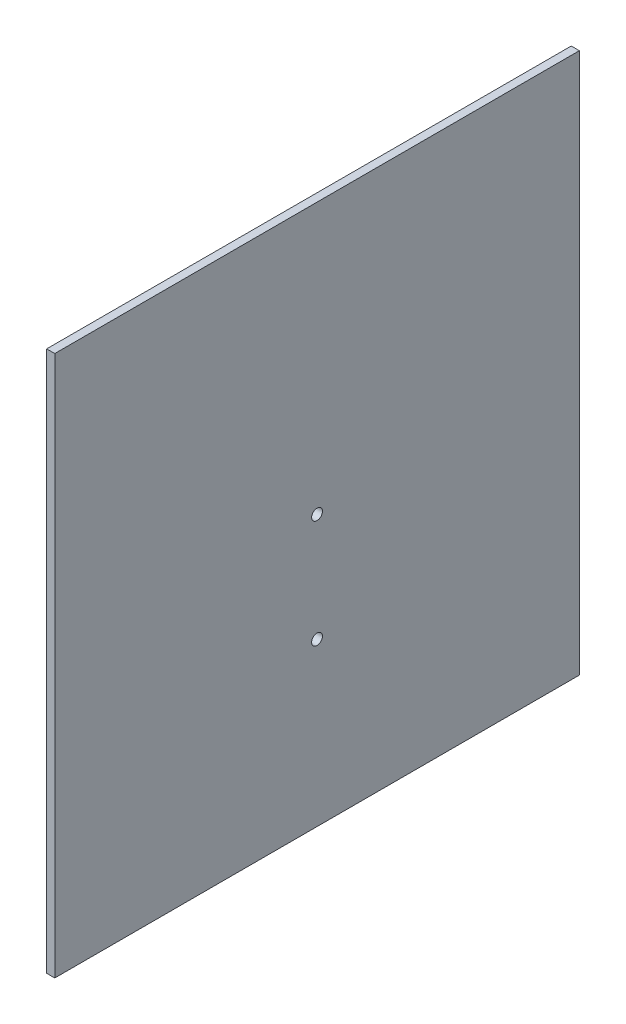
ISO-10303-21;
HEADER;
FILE_DESCRIPTION(('STEP AP214'),'2;1');
FILE_NAME('part.step','',(''),(''),'','','');
FILE_SCHEMA(('AUTOMOTIVE_DESIGN { 1 0 10303 214 1 1 1 1 }'));
ENDSEC;
DATA;
#1=APPLICATION_CONTEXT('core data for automotive mechanical design processes');
#2=APPLICATION_PROTOCOL_DEFINITION('international standard','automotive_design',2000,#1);
#3=PRODUCT_CONTEXT('',#1,'mechanical');
#4=PRODUCT('Part','Part','',(#3));
#5=PRODUCT_RELATED_PRODUCT_CATEGORY('part','',(#4));
#6=PRODUCT_DEFINITION_FORMATION('','',#4);
#7=PRODUCT_DEFINITION_CONTEXT('part definition',#1,'design');
#8=PRODUCT_DEFINITION('design','',#6,#7);
#9=PRODUCT_DEFINITION_SHAPE('','',#8);
#10=(LENGTH_UNIT() NAMED_UNIT(*) SI_UNIT(.MILLI.,.METRE.));
#11=(NAMED_UNIT(*) PLANE_ANGLE_UNIT() SI_UNIT($,.RADIAN.));
#12=(NAMED_UNIT(*) SI_UNIT($,.STERADIAN.) SOLID_ANGLE_UNIT());
#13=UNCERTAINTY_MEASURE_WITH_UNIT(LENGTH_MEASURE(1.E-05),#10,'distance_accuracy_value','');
#14=(GEOMETRIC_REPRESENTATION_CONTEXT(3) GLOBAL_UNCERTAINTY_ASSIGNED_CONTEXT((#13)) GLOBAL_UNIT_ASSIGNED_CONTEXT((#10,
#11,#12)) REPRESENTATION_CONTEXT('',''));
#15=CARTESIAN_POINT('',(0.,0.,0.));
#16=DIRECTION('',(0.,0.,1.));
#17=DIRECTION('',(1.,0.,0.));
#18=AXIS2_PLACEMENT_3D('',#15,#16,#17);
#19=CARTESIAN_POINT('',(3.,100.,-97.));
#20=DIRECTION('',(0.,0.,1.));
#21=DIRECTION('',(0.,-1.,0.));
#22=AXIS2_PLACEMENT_3D('',#19,#20,#21);
#23=PLANE('',#22);
#24=DIRECTION('',(0.,1.,0.));
#25=VECTOR('',#24,1.);
#26=CARTESIAN_POINT('',(0.,100.,-97.));
#27=LINE('',#26,#25);
#28=CARTESIAN_POINT('',(0.,-100.,-97.));
#29=VERTEX_POINT('',#28);
#30=CARTESIAN_POINT('',(0.,100.,-97.));
#31=VERTEX_POINT('',#30);
#32=EDGE_CURVE('E98',#29,#31,#27,.T.);
#33=ORIENTED_EDGE('',*,*,#32,.T.);
#34=DIRECTION('',(-1.,0.,0.));
#35=VECTOR('',#34,1.);
#36=CARTESIAN_POINT('',(3.,100.,-97.));
#37=LINE('',#36,#35);
#38=CARTESIAN_POINT('',(3.,100.,-97.));
#39=VERTEX_POINT('',#38);
#40=EDGE_CURVE('E11',#39,#31,#37,.T.);
#41=ORIENTED_EDGE('',*,*,#40,.F.);
#42=DIRECTION('',(0.,1.,0.));
#43=VECTOR('',#42,1.);
#44=CARTESIAN_POINT('',(3.,100.,-97.));
#45=LINE('',#44,#43);
#46=CARTESIAN_POINT('',(3.,-100.,-97.));
#47=VERTEX_POINT('',#46);
#48=EDGE_CURVE('E85',#47,#39,#45,.T.);
#49=ORIENTED_EDGE('',*,*,#48,.F.);
#50=DIRECTION('',(-1.,0.,0.));
#51=VECTOR('',#50,1.);
#52=CARTESIAN_POINT('',(3.,-100.,-97.));
#53=LINE('',#52,#51);
#54=EDGE_CURVE('E94',#47,#29,#53,.T.);
#55=ORIENTED_EDGE('',*,*,#54,.T.);
#56=EDGE_LOOP('',(#33,#41,#49,#55));
#57=FACE_BOUND('',#56,.T.);
#58=ADVANCED_FACE('F32',(#57),#23,.F.);
#59=CARTESIAN_POINT('',(3.,100.,-97.));
#60=DIRECTION('',(0.,-1.,0.));
#61=DIRECTION('',(0.,0.,-1.));
#62=AXIS2_PLACEMENT_3D('',#59,#60,#61);
#63=PLANE('',#62);
#64=DIRECTION('',(0.,0.,1.));
#65=VECTOR('',#64,1.);
#66=CARTESIAN_POINT('',(0.,100.,-97.));
#67=LINE('',#66,#65);
#68=CARTESIAN_POINT('',(0.,100.,97.));
#69=VERTEX_POINT('',#68);
#70=EDGE_CURVE('E89',#31,#69,#67,.T.);
#71=ORIENTED_EDGE('',*,*,#70,.T.);
#72=DIRECTION('',(-1.,0.,0.));
#73=VECTOR('',#72,1.);
#74=CARTESIAN_POINT('',(3.,100.,97.));
#75=LINE('',#74,#73);
#76=CARTESIAN_POINT('',(3.,100.,97.));
#77=VERTEX_POINT('',#76);
#78=EDGE_CURVE('E41',#77,#69,#75,.T.);
#79=ORIENTED_EDGE('',*,*,#78,.F.);
#80=DIRECTION('',(0.,0.,1.));
#81=VECTOR('',#80,1.);
#82=CARTESIAN_POINT('',(3.,100.,-97.));
#83=LINE('',#82,#81);
#84=EDGE_CURVE('E80',#39,#77,#83,.T.);
#85=ORIENTED_EDGE('',*,*,#84,.F.);
#86=ORIENTED_EDGE('',*,*,#40,.T.);
#87=EDGE_LOOP('',(#71,#79,#85,#86));
#88=FACE_BOUND('',#87,.T.);
#89=ADVANCED_FACE('F88',(#88),#63,.F.);
#90=CARTESIAN_POINT('',(3.,100.,97.));
#91=DIRECTION('',(0.,0.,-1.));
#92=DIRECTION('',(0.,1.,0.));
#93=AXIS2_PLACEMENT_3D('',#90,#91,#92);
#94=PLANE('',#93);
#95=DIRECTION('',(0.,-1.,0.));
#96=VECTOR('',#95,1.);
#97=CARTESIAN_POINT('',(0.,100.,97.));
#98=LINE('',#97,#96);
#99=CARTESIAN_POINT('',(0.,-100.,97.));
#100=VERTEX_POINT('',#99);
#101=EDGE_CURVE('E67',#69,#100,#98,.T.);
#102=ORIENTED_EDGE('',*,*,#101,.T.);
#103=DIRECTION('',(-1.,0.,0.));
#104=VECTOR('',#103,1.);
#105=CARTESIAN_POINT('',(3.,-100.,97.));
#106=LINE('',#105,#104);
#107=CARTESIAN_POINT('',(3.,-100.,97.));
#108=VERTEX_POINT('',#107);
#109=EDGE_CURVE('E90',#108,#100,#106,.T.);
#110=ORIENTED_EDGE('',*,*,#109,.F.);
#111=DIRECTION('',(0.,-1.,0.));
#112=VECTOR('',#111,1.);
#113=CARTESIAN_POINT('',(3.,100.,97.));
#114=LINE('',#113,#112);
#115=EDGE_CURVE('E83',#77,#108,#114,.T.);
#116=ORIENTED_EDGE('',*,*,#115,.F.);
#117=ORIENTED_EDGE('',*,*,#78,.T.);
#118=EDGE_LOOP('',(#102,#110,#116,#117));
#119=FACE_BOUND('',#118,.T.);
#120=ADVANCED_FACE('F92',(#119),#94,.F.);
#121=CARTESIAN_POINT('',(3.,-100.,-97.));
#122=DIRECTION('',(0.,1.,0.));
#123=DIRECTION('',(0.,0.,1.));
#124=AXIS2_PLACEMENT_3D('',#121,#122,#123);
#125=PLANE('',#124);
#126=DIRECTION('',(0.,0.,-1.));
#127=VECTOR('',#126,1.);
#128=CARTESIAN_POINT('',(0.,-100.,-97.));
#129=LINE('',#128,#127);
#130=EDGE_CURVE('E73',#100,#29,#129,.T.);
#131=ORIENTED_EDGE('',*,*,#130,.T.);
#132=ORIENTED_EDGE('',*,*,#54,.F.);
#133=DIRECTION('',(0.,0.,-1.));
#134=VECTOR('',#133,1.);
#135=CARTESIAN_POINT('',(3.,-100.,-97.));
#136=LINE('',#135,#134);
#137=EDGE_CURVE('E50',#108,#47,#136,.T.);
#138=ORIENTED_EDGE('',*,*,#137,.F.);
#139=ORIENTED_EDGE('',*,*,#109,.T.);
#140=EDGE_LOOP('',(#131,#132,#138,#139));
#141=FACE_BOUND('',#140,.T.);
#142=ADVANCED_FACE('F125',(#141),#125,.F.);
#143=CARTESIAN_POINT('',(3.,-100.,-97.));
#144=DIRECTION('',(-1.,0.,0.));
#145=DIRECTION('',(0.,0.,1.));
#146=AXIS2_PLACEMENT_3D('',#143,#144,#145);
#147=PLANE('',#146);
#148=CARTESIAN_POINT('',(3.,-40.,0.));
#149=DIRECTION('',(1.,0.,0.));
#150=DIRECTION('',(0.,0.,-1.));
#151=AXIS2_PLACEMENT_3D('',#148,#149,#150);
#152=CIRCLE('',#151,2.);
#153=CARTESIAN_POINT('',(3.,-40.,-1.99999999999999));
#154=VERTEX_POINT('',#153);
#155=EDGE_CURVE('E115',#154,#154,#152,.T.);
#156=ORIENTED_EDGE('',*,*,#155,.F.);
#157=EDGE_LOOP('',(#156));
#158=FACE_BOUND('',#157,.T.);
#159=CARTESIAN_POINT('',(3.,0.,0.));
#160=DIRECTION('',(1.,0.,0.));
#161=DIRECTION('',(0.,0.,-1.));
#162=AXIS2_PLACEMENT_3D('',#159,#160,#161);
#163=CIRCLE('',#162,2.00000000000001);
#164=CARTESIAN_POINT('',(3.,0.,-2.00000000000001));
#165=VERTEX_POINT('',#164);
#166=EDGE_CURVE('E107',#165,#165,#163,.T.);
#167=ORIENTED_EDGE('',*,*,#166,.F.);
#168=EDGE_LOOP('',(#167));
#169=FACE_BOUND('',#168,.T.);
#170=ORIENTED_EDGE('',*,*,#48,.T.);
#171=ORIENTED_EDGE('',*,*,#84,.T.);
#172=ORIENTED_EDGE('',*,*,#115,.T.);
#173=ORIENTED_EDGE('',*,*,#137,.T.);
#174=EDGE_LOOP('',(#170,#171,#172,#173));
#175=FACE_BOUND('',#174,.T.);
#176=ADVANCED_FACE('F81',(#158,#169,#175),#147,.F.);
#177=CARTESIAN_POINT('',(0.,-100.,-97.));
#178=DIRECTION('',(-1.,0.,0.));
#179=DIRECTION('',(0.,0.,1.));
#180=AXIS2_PLACEMENT_3D('',#177,#178,#179);
#181=PLANE('',#180);
#182=CARTESIAN_POINT('',(0.,-40.,0.));
#183=DIRECTION('',(-1.,0.,0.));
#184=DIRECTION('',(0.,0.,1.));
#185=AXIS2_PLACEMENT_3D('',#182,#183,#184);
#186=CIRCLE('',#185,2.);
#187=CARTESIAN_POINT('',(0.,-40.,2.00000000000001));
#188=VERTEX_POINT('',#187);
#189=EDGE_CURVE('E35',#188,#188,#186,.T.);
#190=ORIENTED_EDGE('',*,*,#189,.F.);
#191=EDGE_LOOP('',(#190));
#192=FACE_BOUND('',#191,.T.);
#193=CARTESIAN_POINT('',(0.,0.,0.));
#194=DIRECTION('',(-1.,0.,0.));
#195=DIRECTION('',(0.,0.,1.));
#196=AXIS2_PLACEMENT_3D('',#193,#194,#195);
#197=CIRCLE('',#196,2.00000000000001);
#198=CARTESIAN_POINT('',(0.,0.,2.00000000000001));
#199=VERTEX_POINT('',#198);
#200=EDGE_CURVE('E101',#199,#199,#197,.T.);
#201=ORIENTED_EDGE('',*,*,#200,.F.);
#202=EDGE_LOOP('',(#201));
#203=FACE_BOUND('',#202,.T.);
#204=ORIENTED_EDGE('',*,*,#32,.F.);
#205=ORIENTED_EDGE('',*,*,#130,.F.);
#206=ORIENTED_EDGE('',*,*,#101,.F.);
#207=ORIENTED_EDGE('',*,*,#70,.F.);
#208=EDGE_LOOP('',(#204,#205,#206,#207));
#209=FACE_BOUND('',#208,.T.);
#210=ADVANCED_FACE('F124',(#192,#203,#209),#181,.T.);
#211=CARTESIAN_POINT('',(-17.,0.,0.));
#212=DIRECTION('',(1.,0.,0.));
#213=DIRECTION('',(0.,0.,-1.));
#214=AXIS2_PLACEMENT_3D('',#211,#212,#213);
#215=CYLINDRICAL_SURFACE('',#214,2.00000000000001);
#216=ORIENTED_EDGE('',*,*,#200,.T.);
#217=EDGE_LOOP('',(#216));
#218=FACE_BOUND('',#217,.T.);
#219=ORIENTED_EDGE('',*,*,#166,.T.);
#220=EDGE_LOOP('',(#219));
#221=FACE_BOUND('',#220,.T.);
#222=ADVANCED_FACE('F131',(#218,#221),#215,.F.);
#223=CARTESIAN_POINT('',(-17.,-40.,0.));
#224=DIRECTION('',(1.,0.,0.));
#225=DIRECTION('',(0.,0.,-1.));
#226=AXIS2_PLACEMENT_3D('',#223,#224,#225);
#227=CYLINDRICAL_SURFACE('',#226,2.);
#228=ORIENTED_EDGE('',*,*,#189,.T.);
#229=EDGE_LOOP('',(#228));
#230=FACE_BOUND('',#229,.T.);
#231=ORIENTED_EDGE('',*,*,#155,.T.);
#232=EDGE_LOOP('',(#231));
#233=FACE_BOUND('',#232,.T.);
#234=ADVANCED_FACE('F120',(#230,#233),#227,.F.);
#235=CLOSED_SHELL('',(#58,#89,#120,#142,#176,#210,#222,#234));
#236=MANIFOLD_SOLID_BREP('B2',#235);
#237=ADVANCED_BREP_SHAPE_REPRESENTATION('',(#18,#236),#14);
#238=SHAPE_DEFINITION_REPRESENTATION(#9,#237);
ENDSEC;
END-ISO-10303-21;
